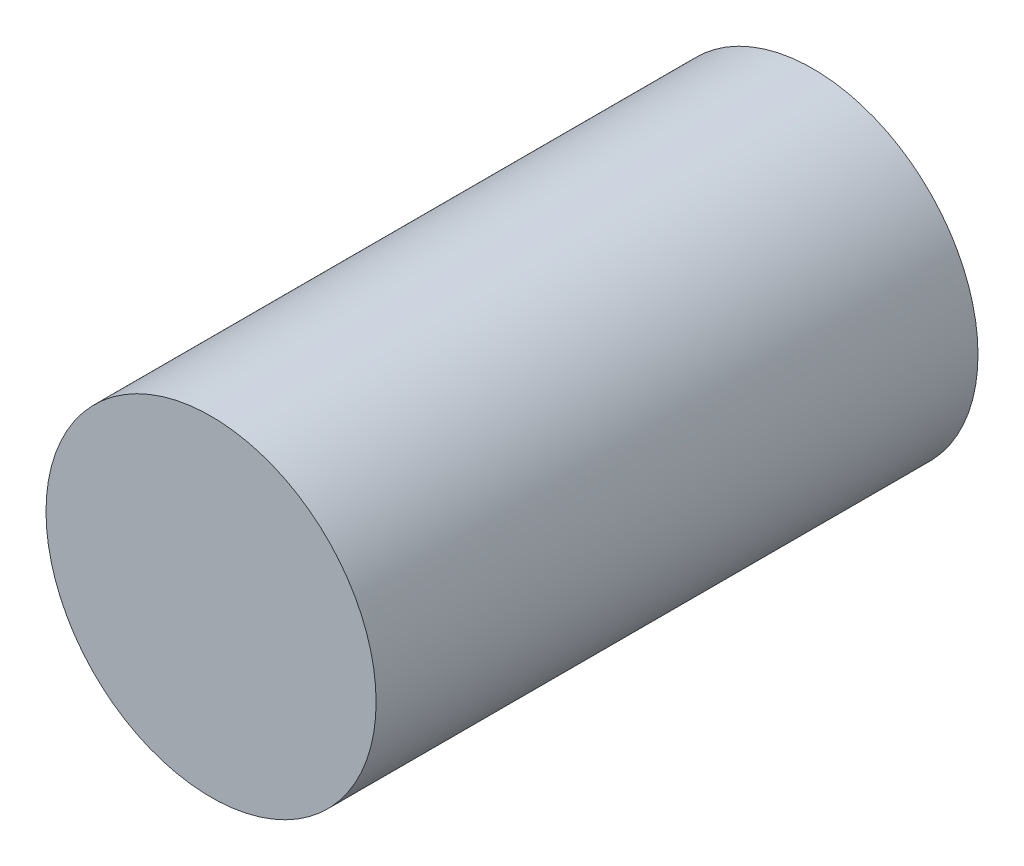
ISO-10303-21;
HEADER;
FILE_DESCRIPTION(('STEP AP214'),'2;1');
FILE_NAME('part.step','',(''),(''),'','','');
FILE_SCHEMA(('AUTOMOTIVE_DESIGN { 1 0 10303 214 1 1 1 1 }'));
ENDSEC;
DATA;
#1=APPLICATION_CONTEXT('core data for automotive mechanical design processes');
#2=APPLICATION_PROTOCOL_DEFINITION('international standard','automotive_design',2000,#1);
#3=PRODUCT_CONTEXT('',#1,'mechanical');
#4=PRODUCT('Part','Part','',(#3));
#5=PRODUCT_RELATED_PRODUCT_CATEGORY('part','',(#4));
#6=PRODUCT_DEFINITION_FORMATION('','',#4);
#7=PRODUCT_DEFINITION_CONTEXT('part definition',#1,'design');
#8=PRODUCT_DEFINITION('design','',#6,#7);
#9=PRODUCT_DEFINITION_SHAPE('','',#8);
#10=(LENGTH_UNIT() NAMED_UNIT(*) SI_UNIT(.MILLI.,.METRE.));
#11=(NAMED_UNIT(*) PLANE_ANGLE_UNIT() SI_UNIT($,.RADIAN.));
#12=(NAMED_UNIT(*) SI_UNIT($,.STERADIAN.) SOLID_ANGLE_UNIT());
#13=UNCERTAINTY_MEASURE_WITH_UNIT(LENGTH_MEASURE(1.E-05),#10,'distance_accuracy_value','');
#14=(GEOMETRIC_REPRESENTATION_CONTEXT(3) GLOBAL_UNCERTAINTY_ASSIGNED_CONTEXT((#13)) GLOBAL_UNIT_ASSIGNED_CONTEXT((#10,
#11,#12)) REPRESENTATION_CONTEXT('',''));
#15=CARTESIAN_POINT('',(0.,0.,0.));
#16=DIRECTION('',(0.,0.,1.));
#17=DIRECTION('',(1.,0.,0.));
#18=AXIS2_PLACEMENT_3D('',#15,#16,#17);
#19=CARTESIAN_POINT('',(0.,0.,-104.760201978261));
#20=DIRECTION('',(0.,0.,1.));
#21=DIRECTION('',(1.,0.,0.));
#22=AXIS2_PLACEMENT_3D('',#19,#20,#21);
#23=CYLINDRICAL_SURFACE('',#22,16.1786745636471);
#24=CARTESIAN_POINT('',(0.,0.,-59.));
#25=DIRECTION('',(0.,0.,1.));
#26=DIRECTION('',(1.,0.,0.));
#27=AXIS2_PLACEMENT_3D('',#24,#25,#26);
#28=CIRCLE('',#27,16.1786745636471);
#29=CARTESIAN_POINT('',(16.1786745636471,0.,-59.));
#30=VERTEX_POINT('',#29);
#31=EDGE_CURVE('E10',#30,#30,#28,.F.);
#32=ORIENTED_EDGE('',*,*,#31,.F.);
#33=EDGE_LOOP('',(#32));
#34=FACE_BOUND('',#33,.T.);
#35=CARTESIAN_POINT('',(0.,0.,0.));
#36=DIRECTION('',(0.,0.,1.));
#37=DIRECTION('',(1.,0.,0.));
#38=AXIS2_PLACEMENT_3D('',#35,#36,#37);
#39=CIRCLE('',#38,16.1786745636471);
#40=CARTESIAN_POINT('',(16.1786745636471,0.,0.));
#41=VERTEX_POINT('',#40);
#42=EDGE_CURVE('E38',#41,#41,#39,.T.);
#43=ORIENTED_EDGE('',*,*,#42,.F.);
#44=EDGE_LOOP('',(#43));
#45=FACE_BOUND('',#44,.T.);
#46=ADVANCED_FACE('F32',(#34,#45),#23,.T.);
#47=CARTESIAN_POINT('',(0.,0.,0.));
#48=DIRECTION('',(0.,0.,1.));
#49=DIRECTION('',(1.,0.,0.));
#50=AXIS2_PLACEMENT_3D('',#47,#48,#49);
#51=PLANE('',#50);
#52=ORIENTED_EDGE('',*,*,#42,.T.);
#53=EDGE_LOOP('',(#52));
#54=FACE_BOUND('',#53,.T.);
#55=ADVANCED_FACE('F44',(#54),#51,.T.);
#56=CARTESIAN_POINT('',(0.,0.,-59.));
#57=DIRECTION('',(0.,0.,1.));
#58=DIRECTION('',(1.,0.,0.));
#59=AXIS2_PLACEMENT_3D('',#56,#57,#58);
#60=PLANE('',#59);
#61=ORIENTED_EDGE('',*,*,#31,.T.);
#62=EDGE_LOOP('',(#61));
#63=FACE_BOUND('',#62,.T.);
#64=ADVANCED_FACE('F51',(#63),#60,.F.);
#65=CLOSED_SHELL('',(#46,#55,#64));
#66=MANIFOLD_SOLID_BREP('B2',#65);
#67=ADVANCED_BREP_SHAPE_REPRESENTATION('',(#18,#66),#14);
#68=SHAPE_DEFINITION_REPRESENTATION(#9,#67);
ENDSEC;
END-ISO-10303-21;
